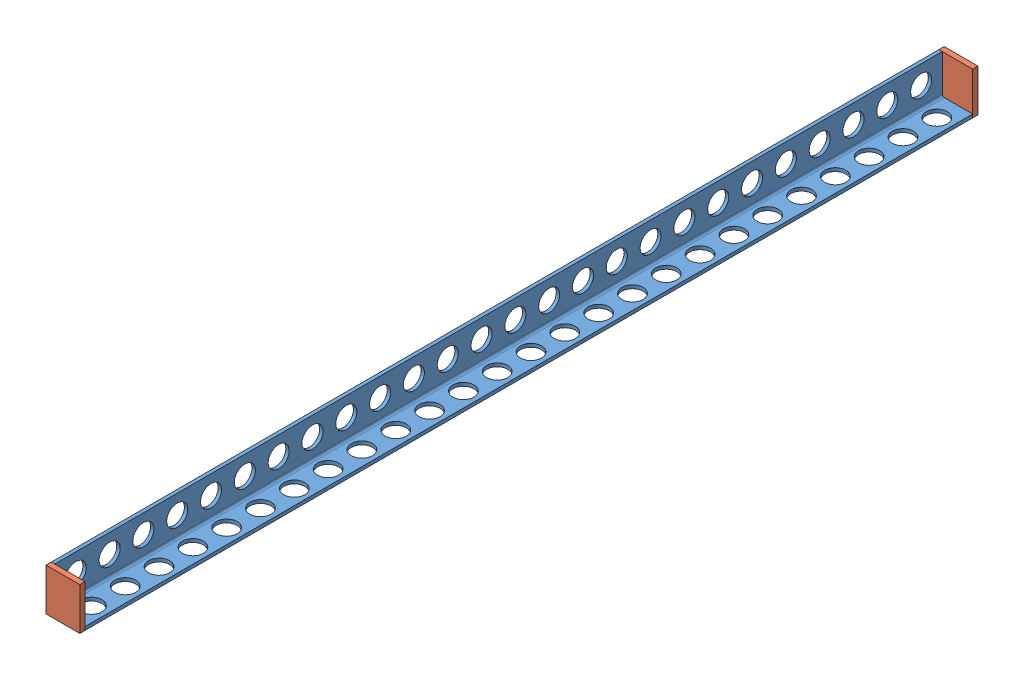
SolidWorks assembly l beam.SLDASM, configuration Default (file format 3400). Lengths in mm.
Overall size (80 100 2125).
3 component instances, 2 part files, 6 mates.
Components (placement in the parent):
- L beam-1: L beam.SLDPRT [Default] at origin size (80 100 2100)
- endplate-1: endplate.SLDPRT [Default] at (-40 0 2100) size (80 100 12.5)
- endplate-2: endplate.SLDPRT [Default] at (-40 0 -12.5) size (80 100 12.5)
Mates (geometry in assembly coordinates):
- Coincident1: coincident anti-aligned: plane of L beam-1 through (-40 0 2100) normal (0 0 1); plane of endplate-1 through (-40 100 2100) normal (0 0 -1)
- Coincident2: coincident aligned: plane of L beam-1 through (-40 100 2100) normal (-1 0 0); plane of endplate-1 through (-40 0 2112.5) normal (-1 0 0)
- Coincident3: coincident aligned: plane of L beam-1 through (-40 0 2100) normal (0 -1 0); plane of endplate-1 through (-40 0 2112.5) normal (0 -1 0)
- Coincident4: coincident anti-aligned: plane of L beam-1 through (-40 0 0) normal (0 0 -1); plane of endplate-2 through (-40 100 0) normal (0 0 1)
- Coincident5: coincident aligned: plane of L beam-1 through (-40 100 2100) normal (-1 0 0); plane of endplate-2 through (-40 0 0) normal (-1 0 0)
- Coincident6: coincident aligned: plane of L beam-1 through (-40 0 2100) normal (0 -1 0); plane of endplate-2 through (-40 0 0) normal (0 -1 0)
